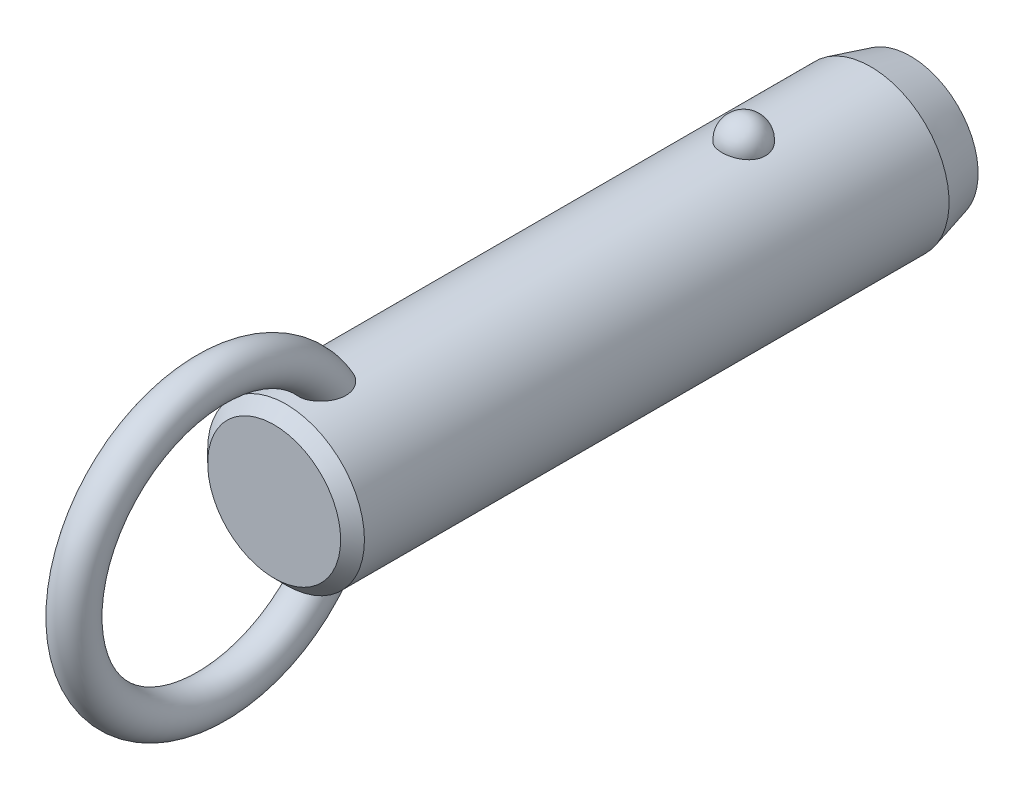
ISO-10303-21;
HEADER;
FILE_DESCRIPTION(('STEP AP214'),'2;1');
FILE_NAME('part.step','',(''),(''),'','','');
FILE_SCHEMA(('AUTOMOTIVE_DESIGN { 1 0 10303 214 1 1 1 1 }'));
ENDSEC;
DATA;
#1=APPLICATION_CONTEXT('core data for automotive mechanical design processes');
#2=APPLICATION_PROTOCOL_DEFINITION('international standard','automotive_design',2000,#1);
#3=PRODUCT_CONTEXT('',#1,'mechanical');
#4=PRODUCT('Part','Part','',(#3));
#5=PRODUCT_RELATED_PRODUCT_CATEGORY('part','',(#4));
#6=PRODUCT_DEFINITION_FORMATION('','',#4);
#7=PRODUCT_DEFINITION_CONTEXT('part definition',#1,'design');
#8=PRODUCT_DEFINITION('design','',#6,#7);
#9=PRODUCT_DEFINITION_SHAPE('','',#8);
#10=(LENGTH_UNIT() NAMED_UNIT(*) SI_UNIT(.MILLI.,.METRE.));
#11=(NAMED_UNIT(*) PLANE_ANGLE_UNIT() SI_UNIT($,.RADIAN.));
#12=(NAMED_UNIT(*) SI_UNIT($,.STERADIAN.) SOLID_ANGLE_UNIT());
#13=UNCERTAINTY_MEASURE_WITH_UNIT(LENGTH_MEASURE(1.E-05),#10,'distance_accuracy_value','');
#14=(GEOMETRIC_REPRESENTATION_CONTEXT(3) GLOBAL_UNCERTAINTY_ASSIGNED_CONTEXT((#13)) GLOBAL_UNIT_ASSIGNED_CONTEXT((#10,
#11,#12)) REPRESENTATION_CONTEXT('',''));
#15=CARTESIAN_POINT('',(0.,0.,0.));
#16=DIRECTION('',(0.,0.,1.));
#17=DIRECTION('',(1.,0.,0.));
#18=AXIS2_PLACEMENT_3D('',#15,#16,#17);
#19=CARTESIAN_POINT('',(0.,0.,35.6));
#20=DIRECTION('',(0.,0.,-1.));
#21=DIRECTION('',(-1.,0.,0.));
#22=AXIS2_PLACEMENT_3D('',#19,#20,#21);
#23=CYLINDRICAL_SURFACE('',#22,7.9);
#24=CARTESIAN_POINT('',(2.1785689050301,7.59367088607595,-2.2));
#25=CARTESIAN_POINT('',(2.17856679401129,7.59367269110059,-2.07701843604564));
#26=CARTESIAN_POINT('',(2.16853481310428,7.59657145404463,-1.95401006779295));
#27=CARTESIAN_POINT('',(2.12864689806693,7.607843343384,-1.71147811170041));
#28=CARTESIAN_POINT('',(2.09878338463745,7.61621856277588,-1.59195587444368));
#29=CARTESIAN_POINT('',(2.0199931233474,7.63749180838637,-1.35985638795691));
#30=CARTESIAN_POINT('',(1.97107475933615,7.6503878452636,-1.24727610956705));
#31=CARTESIAN_POINT('',(1.85539377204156,7.67926115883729,-1.03213234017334));
#32=CARTESIAN_POINT('',(1.78863158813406,7.69523835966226,-0.929568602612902));
#33=CARTESIAN_POINT('',(1.63856494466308,7.7285848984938,-0.736786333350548));
#34=CARTESIAN_POINT('',(1.55518140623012,7.7459606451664,-0.646630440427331));
#35=CARTESIAN_POINT('',(1.37422937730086,7.78009978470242,-0.481747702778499));
#36=CARTESIAN_POINT('',(1.27666086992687,7.79686317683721,-0.407020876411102));
#37=CARTESIAN_POINT('',(1.07024728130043,7.82786153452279,-0.27527810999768));
#38=CARTESIAN_POINT('',(0.961434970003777,7.84210353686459,-0.218212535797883));
#39=CARTESIAN_POINT('',(0.735351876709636,7.86652194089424,-0.123146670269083));
#40=CARTESIAN_POINT('',(0.618082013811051,7.87669878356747,-0.0851443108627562));
#41=CARTESIAN_POINT('',(0.380637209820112,7.89170521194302,-0.0298158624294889));
#42=CARTESIAN_POINT('',(0.260550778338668,7.89662650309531,-0.0121347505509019));
#43=CARTESIAN_POINT('',(0.0190117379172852,7.90090003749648,0.00324379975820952));
#44=CARTESIAN_POINT('',(-0.102440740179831,7.90025280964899,0.000943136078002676));
#45=CARTESIAN_POINT('',(-0.341452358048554,7.89351056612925,-0.0233955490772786));
#46=CARTESIAN_POINT('',(-0.459042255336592,7.88749257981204,-0.045154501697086));
#47=CARTESIAN_POINT('',(-0.688796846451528,7.87075812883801,-0.107408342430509));
#48=CARTESIAN_POINT('',(-0.800961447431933,7.86004158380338,-0.147903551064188));
#49=CARTESIAN_POINT('',(-1.01743634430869,7.83497131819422,-0.246799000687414));
#50=CARTESIAN_POINT('',(-1.12169791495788,7.82059709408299,-0.305300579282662));
#51=CARTESIAN_POINT('',(-1.31891765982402,7.78976470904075,-0.438549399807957));
#52=CARTESIAN_POINT('',(-1.41187469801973,7.77330633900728,-0.51329827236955));
#53=CARTESIAN_POINT('',(-1.58577142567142,7.73972434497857,-0.67862264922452));
#54=CARTESIAN_POINT('',(-1.66645140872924,7.72259402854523,-0.769470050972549));
#55=CARTESIAN_POINT('',(-1.81161503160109,7.68983776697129,-0.963538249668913));
#56=CARTESIAN_POINT('',(-1.87609753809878,7.6742119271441,-1.06675991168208));
#57=CARTESIAN_POINT('',(-1.98790138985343,7.6460202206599,-1.28401170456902));
#58=CARTESIAN_POINT('',(-2.03501994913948,7.63349104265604,-1.39815107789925));
#59=CARTESIAN_POINT('',(-2.10986724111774,7.6131449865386,-1.63301784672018));
#60=CARTESIAN_POINT('',(-2.1375965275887,7.60532797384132,-1.75374505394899));
#61=CARTESIAN_POINT('',(-2.17289256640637,7.5953195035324,-1.99782562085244));
#62=CARTESIAN_POINT('',(-2.18054294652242,7.59310471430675,-2.12116592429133));
#63=CARTESIAN_POINT('',(-2.17572919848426,7.59448538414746,-2.36741799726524));
#64=CARTESIAN_POINT('',(-2.1632656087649,7.59808068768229,-2.49032977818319));
#65=CARTESIAN_POINT('',(-2.11865035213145,7.61064035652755,-2.73161015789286));
#66=CARTESIAN_POINT('',(-2.08659579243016,7.61957823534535,-2.84999812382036));
#67=CARTESIAN_POINT('',(-2.00367799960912,7.64179982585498,-3.07955956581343));
#68=CARTESIAN_POINT('',(-1.9528140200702,7.65508371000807,-3.19073275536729));
#69=CARTESIAN_POINT('',(-1.83321113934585,7.68460381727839,-3.40337899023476));
#70=CARTESIAN_POINT('',(-1.76437735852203,7.70085556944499,-3.50479651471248));
#71=CARTESIAN_POINT('',(-1.61069526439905,7.73445734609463,-3.69446912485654));
#72=CARTESIAN_POINT('',(-1.52584634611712,7.75180741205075,-3.78272371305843));
#73=CARTESIAN_POINT('',(-1.34198059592,7.78574608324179,-3.94393987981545));
#74=CARTESIAN_POINT('',(-1.24291308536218,7.80233167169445,-4.01684434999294));
#75=CARTESIAN_POINT('',(-1.03352039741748,7.83281625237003,-4.14489386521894));
#76=CARTESIAN_POINT('',(-0.92319600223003,7.84671543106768,-4.20004014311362));
#77=CARTESIAN_POINT('',(-0.695822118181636,7.87011575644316,-4.29042017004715));
#78=CARTESIAN_POINT('',(-0.578872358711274,7.87966903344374,-4.32589112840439));
#79=CARTESIAN_POINT('',(-0.340410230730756,7.8935652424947,-4.37692226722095));
#80=CARTESIAN_POINT('',(-0.218898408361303,7.89790879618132,-4.39248482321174));
#81=CARTESIAN_POINT('',(0.0228107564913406,7.90087453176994,-4.4031440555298));
#82=CARTESIAN_POINT('',(0.142990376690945,7.89960185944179,-4.3986168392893));
#83=CARTESIAN_POINT('',(0.380829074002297,7.89171262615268,-4.37008293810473));
#84=CARTESIAN_POINT('',(0.498488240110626,7.8850962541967,-4.34607694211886));
#85=CARTESIAN_POINT('',(0.727535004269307,7.86726442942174,-4.27939317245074));
#86=CARTESIAN_POINT('',(0.838944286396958,7.85606616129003,-4.23678512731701));
#87=CARTESIAN_POINT('',(1.05295421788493,7.83025654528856,-4.13408348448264));
#88=CARTESIAN_POINT('',(1.15555431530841,7.81564498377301,-4.07398879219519));
#89=CARTESIAN_POINT('',(1.35076763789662,7.7843022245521,-3.93687432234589));
#90=CARTESIAN_POINT('',(1.4432046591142,7.76754209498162,-3.85961036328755));
#91=CARTESIAN_POINT('',(1.6139111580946,7.73387857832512,-3.69076949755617));
#92=CARTESIAN_POINT('',(1.6921781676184,7.71697516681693,-3.59919010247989));
#93=CARTESIAN_POINT('',(1.83380875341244,7.6845643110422,-3.40247278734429));
#94=CARTESIAN_POINT('',(1.89689280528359,7.66908588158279,-3.29712873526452));
#95=CARTESIAN_POINT('',(2.0047823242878,7.64159441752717,-3.07707931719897));
#96=CARTESIAN_POINT('',(2.0495945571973,7.62958010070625,-2.96237743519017));
#97=CARTESIAN_POINT('',(2.11580183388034,7.61146617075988,-2.74040519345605));
#98=CARTESIAN_POINT('',(2.13929812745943,7.60484503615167,-2.63379846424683));
#99=CARTESIAN_POINT('',(2.17068242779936,7.59594664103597,-2.41813481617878));
#100=CARTESIAN_POINT('',(2.17857077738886,7.59366928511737,-2.30907795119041));
#101=CARTESIAN_POINT('',(2.1785689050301,7.59367088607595,-2.2));
#102=B_SPLINE_CURVE_WITH_KNOTS('',3,(#24,#25,#26,#27,#28,#29,#30,#31,#32,#33,#34,#35,#36,#37,
#38,#39,#40,#41,#42,#43,#44,#45,#46,#47,#48,#49,#50,#51,#52,#53,#54,#55,#56,#57,#58,#59,#60,#61,
#62,#63,#64,#65,#66,#67,#68,#69,#70,#71,#72,#73,#74,#75,#76,#77,#78,#79,#80,#81,#82,#83,#84,#85,
#86,#87,#88,#89,#90,#91,#92,#93,#94,#95,#96,#97,#98,#99,#100,#101),.UNSPECIFIED.,.T.,.F.,(4,2,2,
2,2,2,2,2,2,2,2,2,2,2,2,2,2,2,2,2,2,2,2,2,2,2,2,2,2,2,2,2,2,2,2,2,2,2,4),(0.,0.368552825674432,
0.737246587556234,1.10577831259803,1.4743009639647,1.8446206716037,2.21494081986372,
2.5842105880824,2.95344028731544,3.31611630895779,3.67875788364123,4.03628044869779,
4.39380913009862,4.75338791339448,5.11300280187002,5.47939989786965,5.8458226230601,
6.21639834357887,6.58696347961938,6.95598276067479,7.32499216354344,7.69218715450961,
8.0593967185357,8.42858578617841,8.79778880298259,9.16834203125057,9.5388695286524,
9.90482699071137,10.2707407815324,10.6298333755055,10.9889132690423,11.3466585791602,
11.7044262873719,12.0676511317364,12.4309391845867,12.8004764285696,13.1698767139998,
13.4967701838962,13.8236564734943),.UNSPECIFIED.);
#103=CARTESIAN_POINT('',(2.1785689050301,7.59367088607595,-2.2));
#104=VERTEX_POINT('',#103);
#105=EDGE_CURVE('E41',#104,#104,#102,.T.);
#106=ORIENTED_EDGE('',*,*,#105,.T.);
#107=EDGE_LOOP('',(#106));
#108=FACE_BOUND('',#107,.T.);
#109=CARTESIAN_POINT('',(0.,0.,43.92));
#110=DIRECTION('',(0.,0.,1.));
#111=DIRECTION('',(1.,0.,0.));
#112=AXIS2_PLACEMENT_3D('',#109,#110,#111);
#113=CIRCLE('',#112,7.9);
#114=CARTESIAN_POINT('',(7.9,0.,43.92));
#115=VERTEX_POINT('',#114);
#116=EDGE_CURVE('E10',#115,#115,#113,.F.);
#117=ORIENTED_EDGE('',*,*,#116,.T.);
#118=EDGE_LOOP('',(#117));
#119=FACE_BOUND('',#118,.T.);
#120=CARTESIAN_POINT('',(-0.63096985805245,-7.87476203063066,37.8124322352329));
#121=CARTESIAN_POINT('',(-0.734180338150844,-7.8664899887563,37.847285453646));
#122=CARTESIAN_POINT('',(-0.834476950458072,-7.85639291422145,37.8908160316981));
#123=CARTESIAN_POINT('',(-1.0262035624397,-7.83366343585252,37.9940948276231));
#124=CARTESIAN_POINT('',(-1.1176141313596,-7.82102565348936,38.0538775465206));
#125=CARTESIAN_POINT('',(-1.28877277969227,-7.79464922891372,38.1878390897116));
#126=CARTESIAN_POINT('',(-1.36854014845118,-7.78091246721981,38.261993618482));
#127=CARTESIAN_POINT('',(-1.5146152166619,-7.75380398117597,38.4224941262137));
#128=CARTESIAN_POINT('',(-1.58092966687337,-7.74043207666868,38.5088339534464));
#129=CARTESIAN_POINT('',(-1.70019064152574,-7.71512522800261,38.6929784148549));
#130=CARTESIAN_POINT('',(-1.75284037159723,-7.70322473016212,38.7909792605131));
#131=CARTESIAN_POINT('',(-1.84263464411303,-7.68224112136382,38.9941029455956));
#132=CARTESIAN_POINT('',(-1.87977299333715,-7.6731591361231,39.0992286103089));
#133=CARTESIAN_POINT('',(-1.94152728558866,-7.65777930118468,39.3232849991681));
#134=CARTESIAN_POINT('',(-1.96475471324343,-7.65179654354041,39.4426167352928));
#135=CARTESIAN_POINT('',(-1.99449499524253,-7.64409642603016,39.6834298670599));
#136=CARTESIAN_POINT('',(-2.0010005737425,-7.64238092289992,39.8049121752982));
#137=CARTESIAN_POINT('',(-1.99856014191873,-7.64302120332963,40.0683409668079));
#138=CARTESIAN_POINT('',(-1.98680021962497,-7.64611845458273,40.2102565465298));
#139=CARTESIAN_POINT('',(-1.94457772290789,-7.65696186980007,40.4911188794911));
#140=CARTESIAN_POINT('',(-1.91409393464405,-7.66471330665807,40.6300620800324));
#141=CARTESIAN_POINT('',(-1.82768670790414,-7.68582947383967,40.931939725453));
#142=CARTESIAN_POINT('',(-1.76772963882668,-7.70003779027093,41.093686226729));
#143=CARTESIAN_POINT('',(-1.65998501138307,-7.72371550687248,41.3276956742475));
#144=CARTESIAN_POINT('',(-1.62107967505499,-7.73200670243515,41.4042974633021));
#145=CARTESIAN_POINT('',(-1.53727726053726,-7.74910377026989,41.5540798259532));
#146=CARTESIAN_POINT('',(-1.4923821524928,-7.75790947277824,41.6272615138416));
#147=CARTESIAN_POINT('',(-1.37397050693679,-7.77993338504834,41.8028838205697));
#148=CARTESIAN_POINT('',(-1.29690364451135,-7.79328473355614,41.9029557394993));
#149=CARTESIAN_POINT('',(-1.12885487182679,-7.81939266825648,42.0907147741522));
#150=CARTESIAN_POINT('',(-1.03789926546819,-7.83215032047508,42.1784247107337));
#151=CARTESIAN_POINT('',(-0.869532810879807,-7.85231710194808,42.3134148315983));
#152=CARTESIAN_POINT('',(-0.795716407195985,-7.86021093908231,42.365076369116));
#153=CARTESIAN_POINT('',(-0.640813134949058,-7.87434920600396,42.4563815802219));
#154=CARTESIAN_POINT('',(-0.559737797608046,-7.88059619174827,42.4960438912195));
#155=CARTESIAN_POINT('',(-0.406456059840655,-7.88984116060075,42.5543008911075));
#156=CARTESIAN_POINT('',(-0.33522794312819,-7.89321892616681,42.5753848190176));
#157=CARTESIAN_POINT('',(-0.190193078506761,-7.89804235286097,42.6054141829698));
#158=CARTESIAN_POINT('',(-0.116388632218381,-7.89948969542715,42.6143701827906));
#159=CARTESIAN_POINT('',(0.031841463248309,-7.90028409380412,42.6192915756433));
#160=CARTESIAN_POINT('',(0.106268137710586,-7.89962640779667,42.6152276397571));
#161=CARTESIAN_POINT('',(0.25329066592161,-7.8962818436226,42.5944615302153));
#162=CARTESIAN_POINT('',(0.325885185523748,-7.8935935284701,42.5777504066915));
#163=CARTESIAN_POINT('',(0.481441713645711,-7.88577340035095,42.5287380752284));
#164=CARTESIAN_POINT('',(0.563611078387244,-7.88026321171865,42.494005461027));
#165=CARTESIAN_POINT('',(0.72112962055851,-7.86741729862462,42.4117965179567));
#166=CARTESIAN_POINT('',(0.796466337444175,-7.86007832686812,42.3642975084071));
#167=CARTESIAN_POINT('',(0.971456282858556,-7.84073285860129,42.236513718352));
#168=CARTESIAN_POINT('',(1.06719686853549,-7.82809461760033,42.1510047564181));
#169=CARTESIAN_POINT('',(1.24418921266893,-7.80192439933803,41.966232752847));
#170=CARTESIAN_POINT('',(1.32540832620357,-7.78839049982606,41.8669395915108));
#171=CARTESIAN_POINT('',(1.45199971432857,-7.76559693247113,41.6895760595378));
#172=CARTESIAN_POINT('',(1.5008564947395,-7.75626094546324,41.6139542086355));
#173=CARTESIAN_POINT('',(1.59197749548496,-7.7380727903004,41.4587428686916));
#174=CARTESIAN_POINT('',(1.63423919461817,-7.72922080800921,41.3791518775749));
#175=CARTESIAN_POINT('',(1.71222612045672,-7.71231959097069,41.2166640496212));
#176=CARTESIAN_POINT('',(1.74794516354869,-7.70427111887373,41.133764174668));
#177=CARTESIAN_POINT('',(1.81270113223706,-7.68929240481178,40.9652967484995));
#178=CARTESIAN_POINT('',(1.84173789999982,-7.68236218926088,40.8797291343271));
#179=CARTESIAN_POINT('',(1.89322698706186,-7.6698375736,40.7052870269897));
#180=CARTESIAN_POINT('',(1.91558744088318,-7.66426199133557,40.6163838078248));
#181=CARTESIAN_POINT('',(1.95281367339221,-7.65485915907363,40.4369696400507));
#182=CARTESIAN_POINT('',(1.96767946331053,-7.65103190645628,40.3464586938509));
#183=CARTESIAN_POINT('',(2.00021456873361,-7.64262981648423,40.0737320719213));
#184=CARTESIAN_POINT('',(2.00600691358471,-7.6410871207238,39.8897099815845));
#185=CARTESIAN_POINT('',(1.98445334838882,-7.64669564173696,39.5765019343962));
#186=CARTESIAN_POINT('',(1.96607186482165,-7.65149688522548,39.446618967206));
#187=CARTESIAN_POINT('',(1.90884967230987,-7.6659762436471,39.1916321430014));
#188=CARTESIAN_POINT('',(1.87002101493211,-7.67565148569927,39.066525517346));
#189=CARTESIAN_POINT('',(1.77063986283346,-7.69918471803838,38.8245401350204));
#190=CARTESIAN_POINT('',(1.70993724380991,-7.71307150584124,38.7077250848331));
#191=CARTESIAN_POINT('',(1.56733070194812,-7.74330306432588,38.4881444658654));
#192=CARTESIAN_POINT('',(1.48543692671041,-7.75964665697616,38.3853722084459));
#193=CARTESIAN_POINT('',(1.31346177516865,-7.79047523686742,38.2093800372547));
#194=CARTESIAN_POINT('',(1.22547278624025,-7.80495298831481,38.1341066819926));
#195=CARTESIAN_POINT('',(1.03724352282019,-7.83218597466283,38.0004864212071));
#196=CARTESIAN_POINT('',(0.937008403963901,-7.84494192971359,37.9421324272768));
#197=CARTESIAN_POINT('',(0.733599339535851,-7.86649045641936,37.8470270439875));
#198=CARTESIAN_POINT('',(0.630941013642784,-7.87547134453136,37.8092109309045));
#199=CARTESIAN_POINT('',(0.420465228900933,-7.88950708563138,37.7511160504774));
#200=CARTESIAN_POINT('',(0.312645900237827,-7.89456050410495,37.7308436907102));
#201=CARTESIAN_POINT('',(0.0960869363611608,-7.9001518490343,37.7084559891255));
#202=CARTESIAN_POINT('',(-0.0126341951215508,-7.90073226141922,37.7061698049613));
#203=CARTESIAN_POINT('',(-0.228766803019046,-7.89742350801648,37.7193678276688));
#204=CARTESIAN_POINT('',(-0.336180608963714,-7.89354403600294,37.7348134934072));
#205=CARTESIAN_POINT('',(-0.47341099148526,-7.88586871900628,37.7662177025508));
#206=CARTESIAN_POINT('',(-0.505257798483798,-7.88388984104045,37.7743541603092));
#207=CARTESIAN_POINT('',(-0.568481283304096,-7.87958326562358,37.7922083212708));
#208=CARTESIAN_POINT('',(-0.599857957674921,-7.87725556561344,37.8019260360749));
#209=CARTESIAN_POINT('',(-0.63096985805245,-7.87476203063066,37.8124322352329));
#210=B_SPLINE_CURVE_WITH_KNOTS('',3,(#120,#121,#122,#123,#124,#125,#126,#127,#128,#129,#130,
#131,#132,#133,#134,#135,#136,#137,#138,#139,#140,#141,#142,#143,#144,#145,#146,#147,#148,#149,
#150,#151,#152,#153,#154,#155,#156,#157,#158,#159,#160,#161,#162,#163,#164,#165,#166,#167,#168,
#169,#170,#171,#172,#173,#174,#175,#176,#177,#178,#179,#180,#181,#182,#183,#184,#185,#186,#187,
#188,#189,#190,#191,#192,#193,#194,#195,#196,#197,#198,#199,#200,#201,#202,#203,#204,#205,#206,
#207,#208,#209),.UNSPECIFIED.,.T.,.F.,(4,2,2,2,2,2,2,2,2,2,2,2,2,2,2,2,2,2,2,2,2,2,2,2,2,2,2,2,
2,2,2,2,2,2,2,2,2,2,2,2,2,2,2,2,4),(0.,0.327622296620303,0.65594559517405,0.983718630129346,
1.3113267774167,1.64554655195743,1.97989964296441,2.34365728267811,2.70757317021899,
3.13333684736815,3.55958380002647,4.07655306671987,4.3352789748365,4.593919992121,
4.9738243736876,5.35301797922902,5.62348245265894,5.89352465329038,6.11565959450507,
6.3376009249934,6.56004255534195,6.782641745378,7.04930844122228,7.31645206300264,
7.70130871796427,8.08701995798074,8.35824509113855,8.62957365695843,8.9011573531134,
9.1727474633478,9.44791855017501,9.72308922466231,10.2715298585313,10.6638393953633,
11.0559179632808,11.4507403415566,11.8453740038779,12.1936425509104,12.5417649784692,
12.8695063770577,13.1973674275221,13.5221104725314,13.8461490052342,13.9449071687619,
14.0436660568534),.UNSPECIFIED.);
#211=CARTESIAN_POINT('',(-0.63096985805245,-7.87476203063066,37.8124322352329));
#212=VERTEX_POINT('',#211);
#213=EDGE_CURVE('E60',#212,#212,#210,.T.);
#214=ORIENTED_EDGE('',*,*,#213,.T.);
#215=EDGE_LOOP('',(#214));
#216=FACE_BOUND('',#215,.T.);
#217=CARTESIAN_POINT('',(-0.63096985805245,7.87476203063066,37.8124322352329));
#218=CARTESIAN_POINT('',(-0.528918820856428,7.88293636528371,37.7779798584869));
#219=CARTESIAN_POINT('',(-0.423745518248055,7.88934810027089,37.751915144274));
#220=CARTESIAN_POINT('',(-0.21023608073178,7.8979273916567,37.7172825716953));
#221=CARTESIAN_POINT('',(-0.10189380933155,7.90008607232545,37.7087513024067));
#222=CARTESIAN_POINT('',(0.114660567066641,7.89990877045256,37.7094570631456));
#223=CARTESIAN_POINT('',(0.222872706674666,7.89757640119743,37.7186798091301));
#224=CARTESIAN_POINT('',(0.436107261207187,7.88867538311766,37.7546525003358));
#225=CARTESIAN_POINT('',(0.541131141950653,7.8821087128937,37.7813942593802));
#226=CARTESIAN_POINT('',(0.74508556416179,7.86545130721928,37.8517561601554));
#227=CARTESIAN_POINT('',(0.844015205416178,7.85536005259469,37.8953787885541));
#228=CARTESIAN_POINT('',(1.03299167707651,7.83275153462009,37.9983796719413));
#229=CARTESIAN_POINT('',(1.12303841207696,7.8202342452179,38.0577580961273));
#230=CARTESIAN_POINT('',(1.29214734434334,7.79408219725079,38.1908647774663));
#231=CARTESIAN_POINT('',(1.37116907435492,7.78044359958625,38.2646436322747));
#232=CARTESIAN_POINT('',(1.51597677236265,7.75353170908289,38.4242353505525));
#233=CARTESIAN_POINT('',(1.58176261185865,7.74025841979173,38.5100483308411));
#234=CARTESIAN_POINT('',(1.70057386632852,7.71504069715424,38.693644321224));
#235=CARTESIAN_POINT('',(1.75320073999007,7.7031425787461,38.7916906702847));
#236=CARTESIAN_POINT('',(1.8429376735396,7.68216822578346,38.9948931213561));
#237=CARTESIAN_POINT('',(1.88004278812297,7.67309289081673,39.1000514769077));
#238=CARTESIAN_POINT('',(1.9417232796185,7.6577294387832,39.3241671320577));
#239=CARTESIAN_POINT('',(1.96491037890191,7.65175648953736,39.4435248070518));
#240=CARTESIAN_POINT('',(1.9945689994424,7.64407702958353,39.6843848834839));
#241=CARTESIAN_POINT('',(2.00103304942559,7.64237242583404,39.8058882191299));
#242=CARTESIAN_POINT('',(1.99850166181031,7.64303650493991,40.0693688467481));
#243=CARTESIAN_POINT('',(1.98669038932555,7.64614714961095,40.2113141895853));
#244=CARTESIAN_POINT('',(1.94436120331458,7.6570170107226,40.4922287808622));
#245=CARTESIAN_POINT('',(1.91382203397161,7.66478150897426,40.6311944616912));
#246=CARTESIAN_POINT('',(1.82728754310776,7.68592483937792,40.9331110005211));
#247=CARTESIAN_POINT('',(1.76725778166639,7.7001468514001,41.0948721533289));
#248=CARTESIAN_POINT('',(1.65939700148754,7.72384204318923,41.3288914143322));
#249=CARTESIAN_POINT('',(1.62045187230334,7.73213852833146,41.4054942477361));
#250=CARTESIAN_POINT('',(1.53656684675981,7.74924489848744,41.5552737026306));
#251=CARTESIAN_POINT('',(1.49162892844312,7.75805461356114,41.6284514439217));
#252=CARTESIAN_POINT('',(1.37317698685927,7.78007342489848,41.8039520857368));
#253=CARTESIAN_POINT('',(1.29612360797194,7.79341423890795,41.9039112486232));
#254=CARTESIAN_POINT('',(1.12812043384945,7.81949839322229,42.0914508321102));
#255=CARTESIAN_POINT('',(1.0371968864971,7.83224280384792,42.1790540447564));
#256=CARTESIAN_POINT('',(0.868871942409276,7.85239026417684,42.3138971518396));
#257=CARTESIAN_POINT('',(0.795056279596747,7.86027769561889,42.3655113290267));
#258=CARTESIAN_POINT('',(0.640160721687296,7.87440222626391,42.4567201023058));
#259=CARTESIAN_POINT('',(0.559092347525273,7.88064188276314,42.4963333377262));
#260=CARTESIAN_POINT('',(0.405820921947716,7.8898738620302,42.5545056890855));
#261=CARTESIAN_POINT('',(0.334594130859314,7.89324577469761,42.5755523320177));
#262=CARTESIAN_POINT('',(0.189568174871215,7.89805733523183,42.6055070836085));
#263=CARTESIAN_POINT('',(0.115771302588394,7.89949866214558,42.6144257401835));
#264=CARTESIAN_POINT('',(-0.0324359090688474,7.90028156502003,42.6192758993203));
#265=CARTESIAN_POINT('',(-0.106847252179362,7.89961843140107,42.6151782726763));
#266=CARTESIAN_POINT('',(-0.253834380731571,7.8962642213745,42.5943519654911));
#267=CARTESIAN_POINT('',(-0.326408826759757,7.89357170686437,42.5776143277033));
#268=CARTESIAN_POINT('',(-0.481962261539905,7.88574179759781,42.5285391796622));
#269=CARTESIAN_POINT('',(-0.564145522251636,7.88022507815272,42.4937638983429));
#270=CARTESIAN_POINT('',(-0.72168526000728,7.86736646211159,42.4114686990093));
#271=CARTESIAN_POINT('',(-0.797029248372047,7.8600213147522,42.3639260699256));
#272=CARTESIAN_POINT('',(-0.972044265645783,7.84066026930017,42.2360267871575));
#273=CARTESIAN_POINT('',(-1.06779803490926,7.82801274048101,42.1504436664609));
#274=CARTESIAN_POINT('',(-1.24480531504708,7.80182621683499,41.9655223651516));
#275=CARTESIAN_POINT('',(-1.32602618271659,7.78828530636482,41.8661540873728));
#276=CARTESIAN_POINT('',(-1.45259834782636,7.76548487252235,41.6886806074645));
#277=CARTESIAN_POINT('',(-1.50143856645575,7.75614818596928,41.6130252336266));
#278=CARTESIAN_POINT('',(-1.59252410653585,7.73796020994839,41.4577484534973));
#279=CARTESIAN_POINT('',(-1.63476690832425,7.72910910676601,41.3781255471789));
#280=CARTESIAN_POINT('',(-1.71271318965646,7.71221133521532,41.2155750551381));
#281=CARTESIAN_POINT('',(-1.74841047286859,7.70416543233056,41.1326444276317));
#282=CARTESIAN_POINT('',(-1.81311929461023,7.6891937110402,40.9641168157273));
#283=CARTESIAN_POINT('',(-1.84213067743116,7.6822679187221,40.8785197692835));
#284=CARTESIAN_POINT('',(-1.89356259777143,7.66975461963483,40.7040254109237));
#285=CARTESIAN_POINT('',(-1.91589165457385,7.66418586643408,40.6150995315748));
#286=CARTESIAN_POINT('',(-1.95305070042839,7.65479859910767,40.4356424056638));
#287=CARTESIAN_POINT('',(-1.96788069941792,7.65098008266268,40.3451111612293));
#288=CARTESIAN_POINT('',(-2.00030078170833,7.64260704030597,40.0723270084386));
#289=CARTESIAN_POINT('',(-2.00600576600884,7.64108760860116,39.8882718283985));
#290=CARTESIAN_POINT('',(-1.98428483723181,7.64673945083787,39.5750800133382));
#291=CARTESIAN_POINT('',(-1.96583698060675,7.6515575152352,39.4452400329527));
#292=CARTESIAN_POINT('',(-1.90848948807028,7.66606613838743,39.1903619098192));
#293=CARTESIAN_POINT('',(-1.86960376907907,7.67575338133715,39.065320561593));
#294=CARTESIAN_POINT('',(-1.7701342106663,7.6993013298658,38.8235009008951));
#295=CARTESIAN_POINT('',(-1.70940488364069,7.71318991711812,38.7067844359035));
#296=CARTESIAN_POINT('',(-1.56672953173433,7.74342495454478,38.4873404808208));
#297=CARTESIAN_POINT('',(-1.48478316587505,7.75977144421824,38.3846132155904));
#298=CARTESIAN_POINT('',(-1.31266325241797,7.79061163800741,38.208643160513));
#299=CARTESIAN_POINT('',(-1.22456383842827,7.80509908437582,38.1333589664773));
#300=CARTESIAN_POINT('',(-1.03622400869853,7.83231881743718,37.9998659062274));
#301=CARTESIAN_POINT('',(-0.936015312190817,7.84505551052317,37.9416137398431));
#302=CARTESIAN_POINT('',(-0.798824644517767,7.85957802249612,37.8775408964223));
#303=CARTESIAN_POINT('',(-0.765787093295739,7.86286821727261,37.8632248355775));
#304=CARTESIAN_POINT('',(-0.698939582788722,7.86909211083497,37.836436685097));
#305=CARTESIAN_POINT('',(-0.665129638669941,7.8720258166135,37.8239645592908));
#306=CARTESIAN_POINT('',(-0.63096985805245,7.87476203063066,37.8124322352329));
#307=B_SPLINE_CURVE_WITH_KNOTS('',3,(#217,#218,#219,#220,#221,#222,#223,#224,#225,#226,#227,
#228,#229,#230,#231,#232,#233,#234,#235,#236,#237,#238,#239,#240,#241,#242,#243,#244,#245,#246,
#247,#248,#249,#250,#251,#252,#253,#254,#255,#256,#257,#258,#259,#260,#261,#262,#263,#264,#265,
#266,#267,#268,#269,#270,#271,#272,#273,#274,#275,#276,#277,#278,#279,#280,#281,#282,#283,#284,
#285,#286,#287,#288,#289,#290,#291,#292,#293,#294,#295,#296,#297,#298,#299,#300,#301,#302,#303,
#304,#305,#306),.UNSPECIFIED.,.T.,.F.,(4,2,2,2,2,2,2,2,2,2,2,2,2,2,2,2,2,2,2,2,2,2,2,2,2,2,2,2,
2,2,2,2,2,2,2,2,2,2,2,2,2,2,2,2,4),(0.,0.323920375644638,0.648516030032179,0.972850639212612,
1.29703380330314,1.62126473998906,1.94549915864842,2.27089401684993,2.59629203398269,
2.93059633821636,3.26500707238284,3.6288164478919,3.99278833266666,4.41865421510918,
4.84500434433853,5.36209210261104,5.62087589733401,5.87957448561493,6.25918598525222,
6.6380878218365,6.90846748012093,7.17842501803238,7.40052350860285,7.62242871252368,
7.84483086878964,8.06739077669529,8.33414615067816,8.60137921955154,8.98641454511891,
9.37230415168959,9.6435867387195,9.91497268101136,10.1866142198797,10.4582620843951,
10.7334745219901,11.0086865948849,11.5572126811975,11.9494246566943,12.3413699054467,
12.7359755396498,13.1305875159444,13.4791770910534,13.82687259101,13.9353013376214,
14.0437279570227),.UNSPECIFIED.);
#308=CARTESIAN_POINT('',(-0.63096985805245,7.87476203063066,37.8124322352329));
#309=VERTEX_POINT('',#308);
#310=EDGE_CURVE('E68',#309,#309,#307,.T.);
#311=ORIENTED_EDGE('',*,*,#310,.T.);
#312=EDGE_LOOP('',(#311));
#313=FACE_BOUND('',#312,.T.);
#314=CARTESIAN_POINT('',(0.,0.,-14.9999999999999));
#315=DIRECTION('',(0.,0.,-1.));
#316=DIRECTION('',(-1.,0.,0.));
#317=AXIS2_PLACEMENT_3D('',#314,#315,#316);
#318=CIRCLE('',#317,7.9);
#319=CARTESIAN_POINT('',(-7.9,0.,-14.9999999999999));
#320=VERTEX_POINT('',#319);
#321=EDGE_CURVE('E57',#320,#320,#318,.F.);
#322=ORIENTED_EDGE('',*,*,#321,.T.);
#323=EDGE_LOOP('',(#322));
#324=FACE_BOUND('',#323,.T.);
#325=ADVANCED_FACE('F37',(#108,#119,#216,#313,#324),#23,.T.);
#326=CARTESIAN_POINT('',(0.,0.,-19.));
#327=DIRECTION('',(0.,0.,-1.));
#328=DIRECTION('',(-1.,0.,0.));
#329=AXIS2_PLACEMENT_3D('',#326,#327,#328);
#330=PLANE('',#329);
#331=CARTESIAN_POINT('',(0.,0.,-19.));
#332=DIRECTION('',(0.,0.,-1.));
#333=DIRECTION('',(-1.,0.,0.));
#334=AXIS2_PLACEMENT_3D('',#331,#332,#333);
#335=CIRCLE('',#334,6.8282032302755);
#336=CARTESIAN_POINT('',(-6.8282032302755,0.,-19.));
#337=VERTEX_POINT('',#336);
#338=EDGE_CURVE('E67',#337,#337,#335,.T.);
#339=ORIENTED_EDGE('',*,*,#338,.T.);
#340=EDGE_LOOP('',(#339));
#341=FACE_BOUND('',#340,.T.);
#342=ADVANCED_FACE('F86',(#341),#330,.T.);
#343=CARTESIAN_POINT('',(0.,0.,-19.));
#344=DIRECTION('',(0.,0.,1.));
#345=DIRECTION('',(1.,0.,0.));
#346=AXIS2_PLACEMENT_3D('',#343,#344,#345);
#347=CONICAL_SURFACE('',#346,6.8282032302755,0.261799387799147);
#348=ORIENTED_EDGE('',*,*,#321,.F.);
#349=EDGE_LOOP('',(#348));
#350=FACE_BOUND('',#349,.T.);
#351=ORIENTED_EDGE('',*,*,#338,.F.);
#352=EDGE_LOOP('',(#351));
#353=FACE_BOUND('',#352,.T.);
#354=ADVANCED_FACE('F84',(#350,#353),#347,.T.);
#355=CARTESIAN_POINT('',(0.,0.,45.12));
#356=DIRECTION('',(0.,0.,1.));
#357=DIRECTION('',(1.,0.,0.));
#358=AXIS2_PLACEMENT_3D('',#355,#356,#357);
#359=PLANE('',#358);
#360=CARTESIAN_POINT('',(0.,0.,45.12));
#361=DIRECTION('',(0.,0.,1.));
#362=DIRECTION('',(1.,0.,0.));
#363=AXIS2_PLACEMENT_3D('',#360,#361,#362);
#364=CIRCLE('',#363,6.70000000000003);
#365=CARTESIAN_POINT('',(6.70000000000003,0.,45.12));
#366=VERTEX_POINT('',#365);
#367=EDGE_CURVE('E50',#366,#366,#364,.T.);
#368=ORIENTED_EDGE('',*,*,#367,.T.);
#369=EDGE_LOOP('',(#368));
#370=FACE_BOUND('',#369,.T.);
#371=ADVANCED_FACE('F78',(#370),#359,.T.);
#372=CARTESIAN_POINT('',(0.,0.,51.45));
#373=DIRECTION('',(1.,0.,0.));
#374=DIRECTION('',(0.,0.,-1.));
#375=AXIS2_PLACEMENT_3D('',#372,#373,#374);
#376=TOROIDAL_SURFACE('',#375,13.85,2.);
#377=ORIENTED_EDGE('',*,*,#310,.F.);
#378=EDGE_LOOP('',(#377));
#379=FACE_BOUND('',#378,.T.);
#380=ORIENTED_EDGE('',*,*,#213,.F.);
#381=EDGE_LOOP('',(#380));
#382=FACE_BOUND('',#381,.T.);
#383=ADVANCED_FACE('F74',(#379,#382),#376,.T.);
#384=CARTESIAN_POINT('',(0.,0.,45.12));
#385=DIRECTION('',(0.,0.,-1.));
#386=DIRECTION('',(-1.,0.,0.));
#387=AXIS2_PLACEMENT_3D('',#384,#385,#386);
#388=CONICAL_SURFACE('',#387,6.70000000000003,0.785398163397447);
#389=ORIENTED_EDGE('',*,*,#116,.F.);
#390=EDGE_LOOP('',(#389));
#391=FACE_BOUND('',#390,.T.);
#392=ORIENTED_EDGE('',*,*,#367,.F.);
#393=EDGE_LOOP('',(#392));
#394=FACE_BOUND('',#393,.T.);
#395=ADVANCED_FACE('F39',(#391,#394),#388,.T.);
#396=CARTESIAN_POINT('',(0.,7.9,-2.2));
#397=DIRECTION('',(0.,1.,0.));
#398=DIRECTION('',(0.,0.,-1.));
#399=AXIS2_PLACEMENT_3D('',#396,#397,#398);
#400=SPHERICAL_SURFACE('',#399,2.2);
#401=ORIENTED_EDGE('',*,*,#105,.F.);
#402=EDGE_LOOP('',(#401));
#403=FACE_BOUND('',#402,.T.);
#404=ADVANCED_FACE('F80',(#403),#400,.T.);
#405=CLOSED_SHELL('',(#325,#342,#354,#371,#383,#395,#404));
#406=MANIFOLD_SOLID_BREP('B2',#405);
#407=ADVANCED_BREP_SHAPE_REPRESENTATION('',(#18,#406),#14);
#408=SHAPE_DEFINITION_REPRESENTATION(#9,#407);
ENDSEC;
END-ISO-10303-21;
